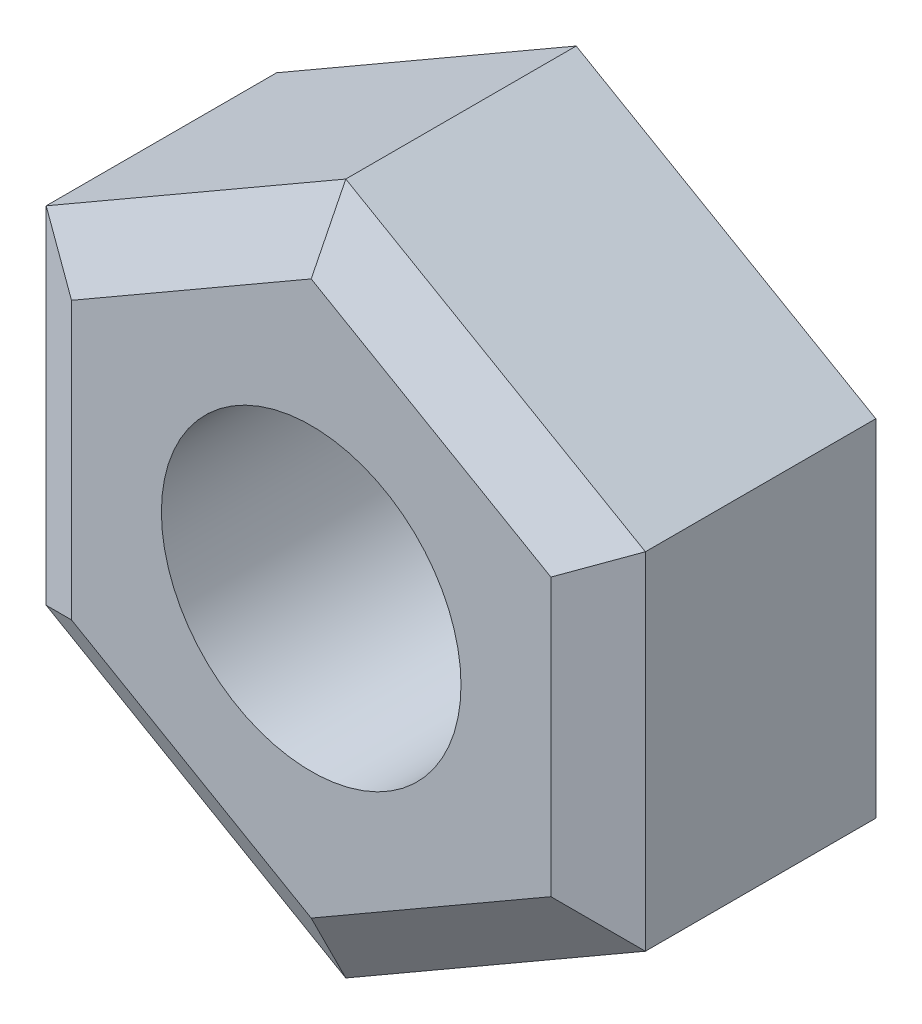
from build123d import *

# Parameters (mm, degrees)
BOSS_EXTRU_1_DEPTH    = 5
TROU_TARAUD_M6X1_01_D = 5
CHANFREIN1_SIZE       = 1
CHANFREIN1_SIZE2      = 0.577350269
CHANFREIN2_SIZE       = 1
CHANFREIN2_SIZE2      = 0.577350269


with BuildPart() as part:
    # Esquisse1 → Boss.-Extru.1 (new body)
    with BuildSketch(Plane.XY):
        Polygon((5, -2.886751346), (5, 2.886751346), (0, 5.773502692), (-5, 2.886751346), (-5, -2.886751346), (0, -5.773502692), align=None)
    extrude(amount=BOSS_EXTRU_1_DEPTH)

    # Trou taraud_ M6x1.01 (through all)
    with Locations(Plane.XY.offset(5)):
        with Locations((0, 0)):
            Hole(TROU_TARAUD_M6X1_01_D / 2)

    # Chanfrein1
    chanfrein1_edges = [part.edges().sort_by_distance(p)[0] for p in [
        (2.5, 4.330127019, 5),
        (-2.5, 4.330127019, 5),
        (-5, 0, 5),
        (-2.5, -4.330127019, 5),
        (2.5, -4.330127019, 5),
        (5, 0, 5),
    ]]
    chanfrein1_side = [part.faces().sort_by_distance(p)[0] for p in [
        (4.847247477, 0, 5),
    ]]
    chamfer(chanfrein1_edges, length=CHANFREIN1_SIZE, length2=CHANFREIN1_SIZE2, reference=chanfrein1_side[0])

    # Chanfrein2
    chanfrein2_edges = [part.edges().sort_by_distance(p)[0] for p in [
        (-2.5, -4.330127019, 0),
        (-5, 0, 0),
        (-2.5, 4.330127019, 0),
        (2.5, 4.330127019, 0),
        (5, 0, 0),
        (2.5, -4.330127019, 0),
    ]]
    chanfrein2_side = [part.faces().sort_by_distance(p)[0] for p in [
        (4.847247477, 0, 0),
    ]]
    chamfer(chanfrein2_edges, length=CHANFREIN2_SIZE, length2=CHANFREIN2_SIZE2, reference=chanfrein2_side[0])


solid = part.part
